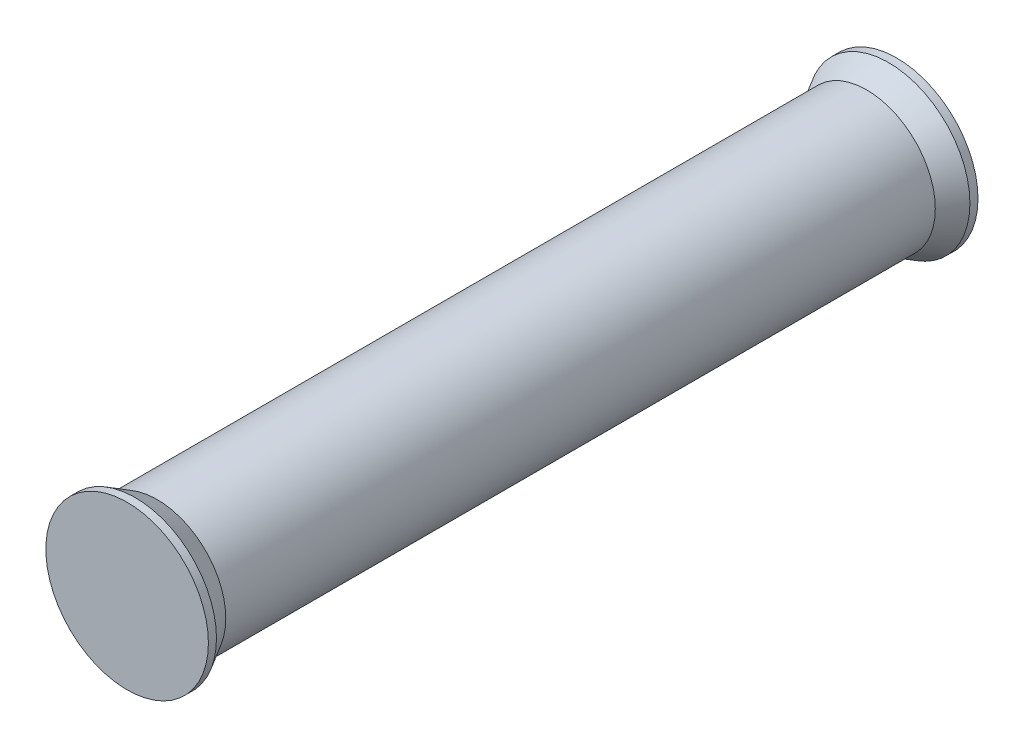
from build123d import *


with BuildPart() as part:
    # Sketch 1 → Revolve 1 (revolve)
    with BuildSketch(Plane(origin=(0, 0, 0), x_dir=(0, 0, -1), z_dir=(1, 0, 0)), mode=Mode.PRIVATE) as revolve_1_sk:
        Polygon((0, 0), (48.8188, 0), (48.8188, 5.1562), (48.306212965, 5.1562), (46.9138, 4.35229), (1.905, 4.35229), (0.512587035, 5.1562), (0, 5.1562), align=None)
    revolve(revolve_1_sk.sketch.rotate(Axis((0, 0, 0), (0, 0, -1)), 90), axis=Axis((0, 0, 0), (0, 0, -1)))


solid = part.part
